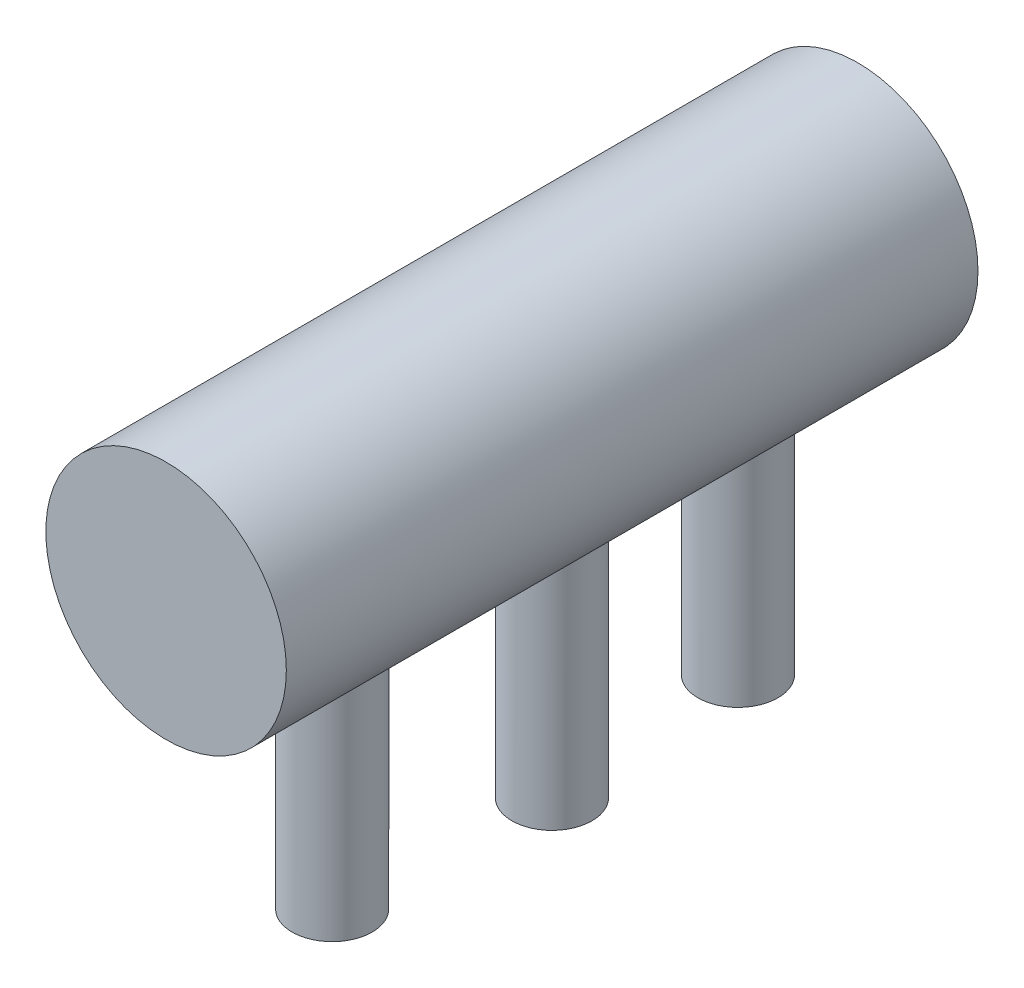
from build123d import *

# Parameters (mm, degrees)
EXTRUSION1_DEPTH      = 4.318
EXTRUSION1_DEPTH_BACK = 4.318
ESQUISSE1_R           = 1.501419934
EXTRUSION2_REACH      = 20.766
EXTRUSION2_END_RADIUS = 1.501419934
ESQUISSE2_R           = 0.5


with BuildPart() as part:
    # Esquisse1 → Extrusion1 (new, two sides: drawn at the far end of the back side and taken through both)
    with BuildSketch(Plane.XY.offset(-EXTRUSION1_DEPTH_BACK)):
        with Locations((15.900399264, 2.490565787)):
            Circle(ESQUISSE1_R)
    extrude(amount=EXTRUSION1_DEPTH + EXTRUSION1_DEPTH_BACK)

    # Extrusion2: up to this cylinder (the profile starts outside it)
    extrusion2_end = Plane(origin=(15.900399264, 2.490565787, 0.042221), z_dir=(0, 0, -1)) * Cylinder(EXTRUSION2_END_RADIUS, 50.601353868, mode=Mode.PRIVATE)
    # Esquisse2 → Extrusion2 (add, up to the surface)
    with BuildSketch(Plane.XZ.offset(1.547311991), mode=Mode.PRIVATE) as extrusion2_sk1:
        with Locations(Location((16.231515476, 2.575477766, 0), (0, 0, 270))):
            Circle(ESQUISSE2_R)
    extrusion2_tool1 = extrude(extrusion2_sk1.sketch, amount=-EXTRUSION2_REACH, mode=Mode.PRIVATE) - extrusion2_end
    add(extrusion2_tool1.solids().sort_by_distance((16.231515, -1.547312, 2.575478))[0])
    # Esquisse2 → Extrusion2 (add, up to the surface)
    with BuildSketch(Plane.XZ.offset(1.547311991), mode=Mode.PRIVATE) as extrusion2_sk2:
        with Locations(Location((16.231515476, -2.491035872, 0), (0, 0, 270))):
            Circle(ESQUISSE2_R)
    extrusion2_tool2 = extrude(extrusion2_sk2.sketch, amount=-EXTRUSION2_REACH, mode=Mode.PRIVATE) - extrusion2_end
    add(extrusion2_tool2.solids().sort_by_distance((16.231515, -1.547312, -2.491036))[0])
    # Esquisse2 → Extrusion2 (add, up to the surface)
    with BuildSketch(Plane.XZ.offset(1.547311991), mode=Mode.PRIVATE) as extrusion2_sk3:
        with Locations(Location((16.400399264, 0, 0), (0, 0, 270))):
            Circle(ESQUISSE2_R)
    extrusion2_tool3 = extrude(extrusion2_sk3.sketch, amount=-EXTRUSION2_REACH, mode=Mode.PRIVATE) - extrusion2_end
    add(extrusion2_tool3.solids().sort_by_distance((16.400399, -1.547312, 0))[0])


solid = part.part
